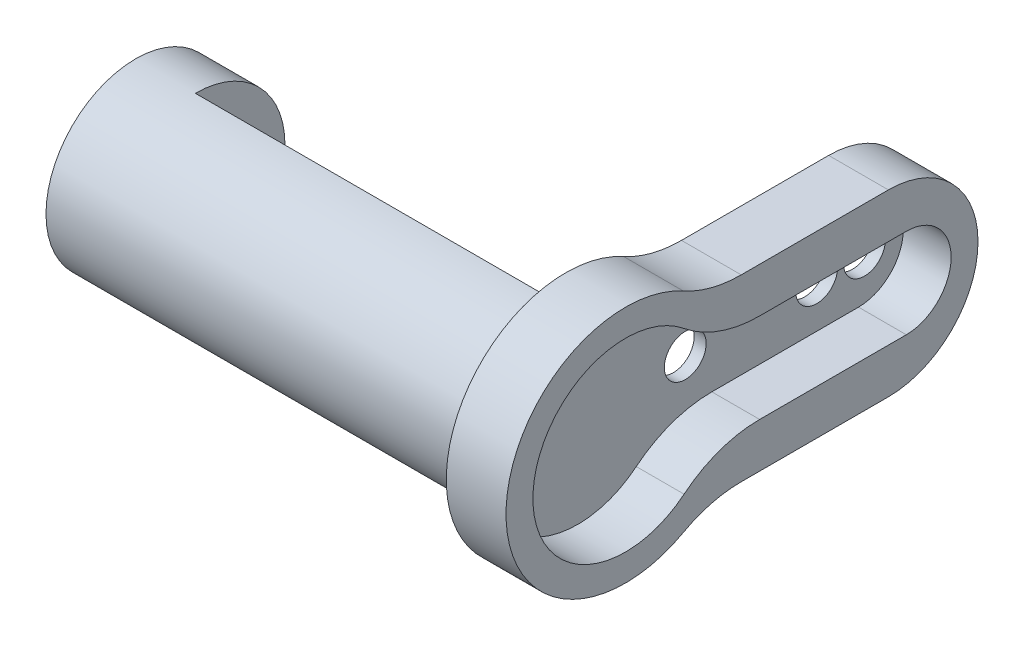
ISO-10303-21;
HEADER;
FILE_DESCRIPTION(('STEP AP214'),'2;1');
FILE_NAME('part.step','',(''),(''),'','','');
FILE_SCHEMA(('AUTOMOTIVE_DESIGN { 1 0 10303 214 1 1 1 1 }'));
ENDSEC;
DATA;
#1=APPLICATION_CONTEXT('core data for automotive mechanical design processes');
#2=APPLICATION_PROTOCOL_DEFINITION('international standard','automotive_design',2000,#1);
#3=PRODUCT_CONTEXT('',#1,'mechanical');
#4=PRODUCT('Part','Part','',(#3));
#5=PRODUCT_RELATED_PRODUCT_CATEGORY('part','',(#4));
#6=PRODUCT_DEFINITION_FORMATION('','',#4);
#7=PRODUCT_DEFINITION_CONTEXT('part definition',#1,'design');
#8=PRODUCT_DEFINITION('design','',#6,#7);
#9=PRODUCT_DEFINITION_SHAPE('','',#8);
#10=(LENGTH_UNIT() NAMED_UNIT(*) SI_UNIT(.MILLI.,.METRE.));
#11=(NAMED_UNIT(*) PLANE_ANGLE_UNIT() SI_UNIT($,.RADIAN.));
#12=(NAMED_UNIT(*) SI_UNIT($,.STERADIAN.) SOLID_ANGLE_UNIT());
#13=UNCERTAINTY_MEASURE_WITH_UNIT(LENGTH_MEASURE(1.E-05),#10,'distance_accuracy_value','');
#14=(GEOMETRIC_REPRESENTATION_CONTEXT(3) GLOBAL_UNCERTAINTY_ASSIGNED_CONTEXT((#13)) GLOBAL_UNIT_ASSIGNED_CONTEXT((#10,
#11,#12)) REPRESENTATION_CONTEXT('',''));
#15=CARTESIAN_POINT('',(0.,0.,0.));
#16=DIRECTION('',(0.,0.,1.));
#17=DIRECTION('',(1.,0.,0.));
#18=AXIS2_PLACEMENT_3D('',#15,#16,#17);
#19=CARTESIAN_POINT('',(18.,0.,0.));
#20=DIRECTION('',(-1.,0.,0.));
#21=DIRECTION('',(0.,0.,1.));
#22=AXIS2_PLACEMENT_3D('',#19,#20,#21);
#23=CYLINDRICAL_SURFACE('',#22,7.5);
#24=CARTESIAN_POINT('',(13.,0.,0.));
#25=DIRECTION('',(1.,0.,0.));
#26=DIRECTION('',(0.,0.,-1.));
#27=AXIS2_PLACEMENT_3D('',#24,#25,#26);
#28=CIRCLE('',#27,7.5);
#29=CARTESIAN_POINT('',(13.,7.5,0.));
#30=VERTEX_POINT('',#29);
#31=CARTESIAN_POINT('',(13.,-7.5,0.));
#32=VERTEX_POINT('',#31);
#33=EDGE_CURVE('E247',#30,#32,#28,.T.);
#34=ORIENTED_EDGE('',*,*,#33,.F.);
#35=DIRECTION('',(-1.,0.,0.));
#36=VECTOR('',#35,1.);
#37=CARTESIAN_POINT('',(29.7705098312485,7.5,0.));
#38=LINE('',#37,#36);
#39=CARTESIAN_POINT('',(-18.,7.5,0.));
#40=VERTEX_POINT('',#39);
#41=EDGE_CURVE('E152',#30,#40,#38,.T.);
#42=ORIENTED_EDGE('',*,*,#41,.T.);
#43=CARTESIAN_POINT('',(-18.,0.,0.));
#44=DIRECTION('',(-1.,0.,0.));
#45=DIRECTION('',(0.,0.,1.));
#46=AXIS2_PLACEMENT_3D('',#43,#44,#45);
#47=CIRCLE('',#46,7.5);
#48=CARTESIAN_POINT('',(-18.,-7.5,0.));
#49=VERTEX_POINT('',#48);
#50=EDGE_CURVE('E139',#40,#49,#47,.T.);
#51=ORIENTED_EDGE('',*,*,#50,.T.);
#52=DIRECTION('',(-1.,0.,0.));
#53=VECTOR('',#52,1.);
#54=CARTESIAN_POINT('',(29.7705098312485,-7.5,0.));
#55=LINE('',#54,#53);
#56=EDGE_CURVE('E150',#32,#49,#55,.T.);
#57=ORIENTED_EDGE('',*,*,#56,.F.);
#58=EDGE_LOOP('',(#34,#42,#51,#57));
#59=FACE_BOUND('',#58,.T.);
#60=CARTESIAN_POINT('',(-23.,0.,0.));
#61=DIRECTION('',(-1.,0.,0.));
#62=DIRECTION('',(0.,0.,1.));
#63=AXIS2_PLACEMENT_3D('',#60,#61,#62);
#64=CIRCLE('',#63,7.5);
#65=CARTESIAN_POINT('',(-23.,0.,7.5));
#66=VERTEX_POINT('',#65);
#67=EDGE_CURVE('E144',#66,#66,#64,.T.);
#68=ORIENTED_EDGE('',*,*,#67,.F.);
#69=EDGE_LOOP('',(#68));
#70=FACE_BOUND('',#69,.T.);
#71=ADVANCED_FACE('F37',(#59,#70),#23,.T.);
#72=CARTESIAN_POINT('',(18.,0.,0.));
#73=DIRECTION('',(1.,0.,0.));
#74=DIRECTION('',(0.,0.,-1.));
#75=AXIS2_PLACEMENT_3D('',#72,#73,#74);
#76=PLANE('',#75);
#77=CARTESIAN_POINT('',(18.,-13.75,-11.2249721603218));
#78=DIRECTION('',(-1.,0.,0.));
#79=DIRECTION('',(0.,0.,-1.));
#80=AXIS2_PLACEMENT_3D('',#77,#78,#79);
#81=CIRCLE('',#80,10.);
#82=CARTESIAN_POINT('',(18.,-6.00352112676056,-4.90104418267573));
#83=VERTEX_POINT('',#82);
#84=CARTESIAN_POINT('',(18.,-3.75,-11.2249721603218));
#85=VERTEX_POINT('',#84);
#86=EDGE_CURVE('E52',#83,#85,#81,.T.);
#87=ORIENTED_EDGE('',*,*,#86,.F.);
#88=CARTESIAN_POINT('',(18.,0.,0.));
#89=DIRECTION('',(1.,0.,0.));
#90=DIRECTION('',(0.,0.,-1.));
#91=AXIS2_PLACEMENT_3D('',#88,#89,#90);
#92=CIRCLE('',#91,7.75);
#93=CARTESIAN_POINT('',(18.,6.00352112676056,-4.90104418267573));
#94=VERTEX_POINT('',#93);
#95=EDGE_CURVE('E182',#94,#83,#92,.T.);
#96=ORIENTED_EDGE('',*,*,#95,.F.);
#97=CARTESIAN_POINT('',(18.,13.75,-11.2249721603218));
#98=DIRECTION('',(-1.,0.,0.));
#99=DIRECTION('',(0.,0.,1.));
#100=AXIS2_PLACEMENT_3D('',#97,#98,#99);
#101=CIRCLE('',#100,10.);
#102=CARTESIAN_POINT('',(18.,3.75,-11.2249721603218));
#103=VERTEX_POINT('',#102);
#104=EDGE_CURVE('E208',#103,#94,#101,.T.);
#105=ORIENTED_EDGE('',*,*,#104,.F.);
#106=DIRECTION('',(0.,0.,1.));
#107=VECTOR('',#106,1.);
#108=CARTESIAN_POINT('',(18.,3.75,-23.5));
#109=LINE('',#108,#107);
#110=CARTESIAN_POINT('',(18.,3.75,-23.5));
#111=VERTEX_POINT('',#110);
#112=EDGE_CURVE('E205',#111,#103,#109,.T.);
#113=ORIENTED_EDGE('',*,*,#112,.F.);
#114=CARTESIAN_POINT('',(18.,0.,-23.5));
#115=DIRECTION('',(1.,0.,0.));
#116=DIRECTION('',(0.,0.,-1.));
#117=AXIS2_PLACEMENT_3D('',#114,#115,#116);
#118=CIRCLE('',#117,3.75);
#119=CARTESIAN_POINT('',(18.,-3.75,-23.5));
#120=VERTEX_POINT('',#119);
#121=EDGE_CURVE('E202',#120,#111,#118,.T.);
#122=ORIENTED_EDGE('',*,*,#121,.F.);
#123=DIRECTION('',(0.,0.,-1.));
#124=VECTOR('',#123,1.);
#125=CARTESIAN_POINT('',(18.,-3.75,-23.5));
#126=LINE('',#125,#124);
#127=EDGE_CURVE('E199',#85,#120,#126,.T.);
#128=ORIENTED_EDGE('',*,*,#127,.F.);
#129=EDGE_LOOP('',(#87,#96,#105,#113,#122,#128));
#130=FACE_BOUND('',#129,.T.);
#131=DIRECTION('',(0.,0.,1.));
#132=VECTOR('',#131,1.);
#133=CARTESIAN_POINT('',(18.,7.5,0.));
#134=LINE('',#133,#132);
#135=CARTESIAN_POINT('',(18.,7.5,-22.));
#136=VERTEX_POINT('',#135);
#137=CARTESIAN_POINT('',(18.,7.5,-9.68245836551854));
#138=VERTEX_POINT('',#137);
#139=EDGE_CURVE('E233',#136,#138,#134,.T.);
#140=ORIENTED_EDGE('',*,*,#139,.T.);
#141=CARTESIAN_POINT('',(18.,17.5,-9.68245836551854));
#142=DIRECTION('',(1.,0.,0.));
#143=DIRECTION('',(0.,0.,-1.));
#144=AXIS2_PLACEMENT_3D('',#141,#142,#143);
#145=CIRCLE('',#144,10.);
#146=CARTESIAN_POINT('',(18.,8.75,-4.84122918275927));
#147=VERTEX_POINT('',#146);
#148=EDGE_CURVE('E11',#138,#147,#145,.F.);
#149=ORIENTED_EDGE('',*,*,#148,.T.);
#150=CARTESIAN_POINT('',(18.,0.,0.));
#151=DIRECTION('',(1.,0.,0.));
#152=DIRECTION('',(0.,0.,-1.));
#153=AXIS2_PLACEMENT_3D('',#150,#151,#152);
#154=CIRCLE('',#153,10.);
#155=CARTESIAN_POINT('',(18.,-8.75,-4.84122918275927));
#156=VERTEX_POINT('',#155);
#157=EDGE_CURVE('E215',#147,#156,#154,.T.);
#158=ORIENTED_EDGE('',*,*,#157,.T.);
#159=CARTESIAN_POINT('',(18.,-17.5,-9.68245836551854));
#160=DIRECTION('',(1.,0.,0.));
#161=DIRECTION('',(0.,0.,-1.));
#162=AXIS2_PLACEMENT_3D('',#159,#160,#161);
#163=CIRCLE('',#162,10.);
#164=CARTESIAN_POINT('',(18.,-7.5,-9.68245836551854));
#165=VERTEX_POINT('',#164);
#166=EDGE_CURVE('E261',#156,#165,#163,.F.);
#167=ORIENTED_EDGE('',*,*,#166,.T.);
#168=DIRECTION('',(0.,0.,-1.));
#169=VECTOR('',#168,1.);
#170=CARTESIAN_POINT('',(18.,-7.5,0.));
#171=LINE('',#170,#169);
#172=CARTESIAN_POINT('',(18.,-7.5,-22.));
#173=VERTEX_POINT('',#172);
#174=EDGE_CURVE('E229',#165,#173,#171,.T.);
#175=ORIENTED_EDGE('',*,*,#174,.T.);
#176=CARTESIAN_POINT('',(18.,0.,-22.));
#177=DIRECTION('',(1.,0.,0.));
#178=DIRECTION('',(0.,0.,-1.));
#179=AXIS2_PLACEMENT_3D('',#176,#177,#178);
#180=CIRCLE('',#179,7.5);
#181=EDGE_CURVE('E240',#173,#136,#180,.T.);
#182=ORIENTED_EDGE('',*,*,#181,.T.);
#183=EDGE_LOOP('',(#140,#149,#158,#167,#175,#182));
#184=FACE_BOUND('',#183,.T.);
#185=ADVANCED_FACE('F279',(#130,#184),#76,.T.);
#186=CARTESIAN_POINT('',(13.,7.5,0.));
#187=DIRECTION('',(0.,1.,0.));
#188=DIRECTION('',(0.,0.,1.));
#189=AXIS2_PLACEMENT_3D('',#186,#187,#188);
#190=PLANE('',#189);
#191=DIRECTION('',(0.,0.,1.));
#192=VECTOR('',#191,1.);
#193=CARTESIAN_POINT('',(13.,7.5,0.));
#194=LINE('',#193,#192);
#195=CARTESIAN_POINT('',(13.,7.5,-22.));
#196=VERTEX_POINT('',#195);
#197=CARTESIAN_POINT('',(13.,7.5,-9.68245836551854));
#198=VERTEX_POINT('',#197);
#199=EDGE_CURVE('E236',#196,#198,#194,.T.);
#200=ORIENTED_EDGE('',*,*,#199,.T.);
#201=DIRECTION('',(-1.,0.,0.));
#202=VECTOR('',#201,1.);
#203=CARTESIAN_POINT('',(18.,7.5,-9.68245836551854));
#204=LINE('',#203,#202);
#205=EDGE_CURVE('E259',#198,#138,#204,.F.);
#206=ORIENTED_EDGE('',*,*,#205,.T.);
#207=ORIENTED_EDGE('',*,*,#139,.F.);
#208=DIRECTION('',(1.,0.,0.));
#209=VECTOR('',#208,1.);
#210=CARTESIAN_POINT('',(13.,7.5,-22.));
#211=LINE('',#210,#209);
#212=EDGE_CURVE('E245',#196,#136,#211,.T.);
#213=ORIENTED_EDGE('',*,*,#212,.F.);
#214=EDGE_LOOP('',(#200,#206,#207,#213));
#215=FACE_BOUND('',#214,.T.);
#216=ADVANCED_FACE('F289',(#215),#190,.T.);
#217=CARTESIAN_POINT('',(13.,0.,-22.));
#218=DIRECTION('',(1.,0.,0.));
#219=DIRECTION('',(0.,0.,-1.));
#220=AXIS2_PLACEMENT_3D('',#217,#218,#219);
#221=CYLINDRICAL_SURFACE('',#220,7.5);
#222=ORIENTED_EDGE('',*,*,#181,.F.);
#223=DIRECTION('',(1.,0.,0.));
#224=VECTOR('',#223,1.);
#225=CARTESIAN_POINT('',(13.,-7.5,-22.));
#226=LINE('',#225,#224);
#227=CARTESIAN_POINT('',(13.,-7.5,-22.));
#228=VERTEX_POINT('',#227);
#229=EDGE_CURVE('E238',#228,#173,#226,.T.);
#230=ORIENTED_EDGE('',*,*,#229,.F.);
#231=CARTESIAN_POINT('',(13.,0.,-22.));
#232=DIRECTION('',(1.,0.,0.));
#233=DIRECTION('',(0.,0.,-1.));
#234=AXIS2_PLACEMENT_3D('',#231,#232,#233);
#235=CIRCLE('',#234,7.5);
#236=EDGE_CURVE('E232',#228,#196,#235,.T.);
#237=ORIENTED_EDGE('',*,*,#236,.T.);
#238=ORIENTED_EDGE('',*,*,#212,.T.);
#239=EDGE_LOOP('',(#222,#230,#237,#238));
#240=FACE_BOUND('',#239,.T.);
#241=ADVANCED_FACE('F285',(#240),#221,.T.);
#242=CARTESIAN_POINT('',(13.,-7.5,0.));
#243=DIRECTION('',(0.,-1.,0.));
#244=DIRECTION('',(0.,0.,-1.));
#245=AXIS2_PLACEMENT_3D('',#242,#243,#244);
#246=PLANE('',#245);
#247=ORIENTED_EDGE('',*,*,#174,.F.);
#248=DIRECTION('',(-1.,0.,0.));
#249=VECTOR('',#248,1.);
#250=CARTESIAN_POINT('',(13.,-7.5,-9.68245836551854));
#251=LINE('',#250,#249);
#252=CARTESIAN_POINT('',(13.,-7.5,-9.68245836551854));
#253=VERTEX_POINT('',#252);
#254=EDGE_CURVE('E257',#165,#253,#251,.T.);
#255=ORIENTED_EDGE('',*,*,#254,.T.);
#256=DIRECTION('',(0.,0.,-1.));
#257=VECTOR('',#256,1.);
#258=CARTESIAN_POINT('',(13.,-7.5,0.));
#259=LINE('',#258,#257);
#260=EDGE_CURVE('E230',#253,#228,#259,.T.);
#261=ORIENTED_EDGE('',*,*,#260,.T.);
#262=ORIENTED_EDGE('',*,*,#229,.T.);
#263=EDGE_LOOP('',(#247,#255,#261,#262));
#264=FACE_BOUND('',#263,.T.);
#265=ADVANCED_FACE('F281',(#264),#246,.T.);
#266=CARTESIAN_POINT('',(13.,0.,0.));
#267=DIRECTION('',(1.,0.,0.));
#268=DIRECTION('',(0.,0.,-1.));
#269=AXIS2_PLACEMENT_3D('',#266,#267,#268);
#270=PLANE('',#269);
#271=ORIENTED_EDGE('',*,*,#33,.T.);
#272=DIRECTION('',(0.,1.,0.));
#273=VECTOR('',#272,1.);
#274=CARTESIAN_POINT('',(13.,7.5,0.));
#275=LINE('',#274,#273);
#276=EDGE_CURVE('E143',#32,#30,#275,.T.);
#277=ORIENTED_EDGE('',*,*,#276,.T.);
#278=EDGE_LOOP('',(#271,#277));
#279=FACE_BOUND('',#278,.T.);
#280=CARTESIAN_POINT('',(13.,0.,-24.));
#281=DIRECTION('',(1.,0.,0.));
#282=DIRECTION('',(0.,0.,-1.));
#283=AXIS2_PLACEMENT_3D('',#280,#281,#282);
#284=CIRCLE('',#283,1.75);
#285=CARTESIAN_POINT('',(13.,0.,-25.75));
#286=VERTEX_POINT('',#285);
#287=EDGE_CURVE('E175',#286,#286,#284,.T.);
#288=ORIENTED_EDGE('',*,*,#287,.T.);
#289=EDGE_LOOP('',(#288));
#290=FACE_BOUND('',#289,.T.);
#291=CARTESIAN_POINT('',(13.,0.,-20.));
#292=DIRECTION('',(1.,0.,0.));
#293=DIRECTION('',(0.,0.,-1.));
#294=AXIS2_PLACEMENT_3D('',#291,#292,#293);
#295=CIRCLE('',#294,1.75);
#296=CARTESIAN_POINT('',(13.,0.,-21.75));
#297=VERTEX_POINT('',#296);
#298=EDGE_CURVE('E172',#297,#297,#295,.T.);
#299=ORIENTED_EDGE('',*,*,#298,.T.);
#300=EDGE_LOOP('',(#299));
#301=FACE_BOUND('',#300,.T.);
#302=CARTESIAN_POINT('',(13.,0.,-9.00000000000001));
#303=DIRECTION('',(1.,0.,0.));
#304=DIRECTION('',(0.,0.,-1.));
#305=AXIS2_PLACEMENT_3D('',#302,#303,#304);
#306=CIRCLE('',#305,1.75);
#307=CARTESIAN_POINT('',(13.,0.,-10.75));
#308=VERTEX_POINT('',#307);
#309=EDGE_CURVE('E167',#308,#308,#306,.T.);
#310=ORIENTED_EDGE('',*,*,#309,.T.);
#311=EDGE_LOOP('',(#310));
#312=FACE_BOUND('',#311,.T.);
#313=ORIENTED_EDGE('',*,*,#260,.F.);
#314=CARTESIAN_POINT('',(13.,-17.5,-9.68245836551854));
#315=DIRECTION('',(1.,0.,0.));
#316=DIRECTION('',(0.,0.,-1.));
#317=AXIS2_PLACEMENT_3D('',#314,#315,#316);
#318=CIRCLE('',#317,10.);
#319=CARTESIAN_POINT('',(13.,-8.75,-4.84122918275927));
#320=VERTEX_POINT('',#319);
#321=EDGE_CURVE('E263',#253,#320,#318,.T.);
#322=ORIENTED_EDGE('',*,*,#321,.T.);
#323=CARTESIAN_POINT('',(13.,0.,0.));
#324=DIRECTION('',(1.,0.,0.));
#325=DIRECTION('',(0.,0.,-1.));
#326=AXIS2_PLACEMENT_3D('',#323,#324,#325);
#327=CIRCLE('',#326,10.);
#328=CARTESIAN_POINT('',(13.,8.75,-4.84122918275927));
#329=VERTEX_POINT('',#328);
#330=EDGE_CURVE('E227',#320,#329,#327,.F.);
#331=ORIENTED_EDGE('',*,*,#330,.T.);
#332=CARTESIAN_POINT('',(13.,17.5,-9.68245836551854));
#333=DIRECTION('',(1.,0.,0.));
#334=DIRECTION('',(0.,0.,-1.));
#335=AXIS2_PLACEMENT_3D('',#332,#333,#334);
#336=CIRCLE('',#335,10.);
#337=EDGE_CURVE('E45',#329,#198,#336,.T.);
#338=ORIENTED_EDGE('',*,*,#337,.T.);
#339=ORIENTED_EDGE('',*,*,#199,.F.);
#340=ORIENTED_EDGE('',*,*,#236,.F.);
#341=EDGE_LOOP('',(#313,#322,#331,#338,#339,#340));
#342=FACE_BOUND('',#341,.T.);
#343=ADVANCED_FACE('F267',(#279,#290,#301,#312,#342),#270,.F.);
#344=CARTESIAN_POINT('',(-15.2842712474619,0.,0.));
#345=DIRECTION('',(1.,0.,0.));
#346=DIRECTION('',(0.,0.,-1.));
#347=AXIS2_PLACEMENT_3D('',#344,#345,#346);
#348=CYLINDRICAL_SURFACE('',#347,10.);
#349=ORIENTED_EDGE('',*,*,#330,.F.);
#350=DIRECTION('',(1.,0.,0.));
#351=VECTOR('',#350,1.);
#352=CARTESIAN_POINT('',(-15.2842712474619,-8.75,-4.84122918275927));
#353=LINE('',#352,#351);
#354=EDGE_CURVE('E254',#320,#156,#353,.T.);
#355=ORIENTED_EDGE('',*,*,#354,.T.);
#356=ORIENTED_EDGE('',*,*,#157,.F.);
#357=DIRECTION('',(1.,0.,0.));
#358=VECTOR('',#357,1.);
#359=CARTESIAN_POINT('',(-15.2842712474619,8.75,-4.84122918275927));
#360=LINE('',#359,#358);
#361=EDGE_CURVE('E251',#147,#329,#360,.F.);
#362=ORIENTED_EDGE('',*,*,#361,.T.);
#363=EDGE_LOOP('',(#349,#355,#356,#362));
#364=FACE_BOUND('',#363,.T.);
#365=ADVANCED_FACE('F273',(#364),#348,.T.);
#366=CARTESIAN_POINT('',(-15.2842712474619,-17.5,-9.68245836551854));
#367=DIRECTION('',(1.,0.,0.));
#368=DIRECTION('',(0.,0.,-1.));
#369=AXIS2_PLACEMENT_3D('',#366,#367,#368);
#370=CYLINDRICAL_SURFACE('',#369,10.);
#371=ORIENTED_EDGE('',*,*,#321,.F.);
#372=ORIENTED_EDGE('',*,*,#254,.F.);
#373=ORIENTED_EDGE('',*,*,#166,.F.);
#374=ORIENTED_EDGE('',*,*,#354,.F.);
#375=EDGE_LOOP('',(#371,#372,#373,#374));
#376=FACE_BOUND('',#375,.T.);
#377=ADVANCED_FACE('F276',(#376),#370,.F.);
#378=CARTESIAN_POINT('',(-15.2842712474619,17.5,-9.68245836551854));
#379=DIRECTION('',(1.,0.,0.));
#380=DIRECTION('',(0.,0.,-1.));
#381=AXIS2_PLACEMENT_3D('',#378,#379,#380);
#382=CYLINDRICAL_SURFACE('',#381,10.);
#383=ORIENTED_EDGE('',*,*,#148,.F.);
#384=ORIENTED_EDGE('',*,*,#205,.F.);
#385=ORIENTED_EDGE('',*,*,#337,.F.);
#386=ORIENTED_EDGE('',*,*,#361,.F.);
#387=EDGE_LOOP('',(#383,#384,#385,#386));
#388=FACE_BOUND('',#387,.T.);
#389=ADVANCED_FACE('F39',(#388),#382,.F.);
#390=CARTESIAN_POINT('',(14.,-13.75,-11.2249721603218));
#391=DIRECTION('',(1.,0.,0.));
#392=DIRECTION('',(0.,0.,-1.));
#393=AXIS2_PLACEMENT_3D('',#390,#391,#392);
#394=CYLINDRICAL_SURFACE('',#393,10.);
#395=ORIENTED_EDGE('',*,*,#86,.T.);
#396=DIRECTION('',(1.,0.,0.));
#397=VECTOR('',#396,1.);
#398=CARTESIAN_POINT('',(14.,-3.75,-11.2249721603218));
#399=LINE('',#398,#397);
#400=CARTESIAN_POINT('',(14.,-3.75,-11.2249721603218));
#401=VERTEX_POINT('',#400);
#402=EDGE_CURVE('E197',#401,#85,#399,.T.);
#403=ORIENTED_EDGE('',*,*,#402,.F.);
#404=CARTESIAN_POINT('',(14.,-13.75,-11.2249721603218));
#405=DIRECTION('',(-1.,0.,0.));
#406=DIRECTION('',(0.,0.,-1.));
#407=AXIS2_PLACEMENT_3D('',#404,#405,#406);
#408=CIRCLE('',#407,10.);
#409=CARTESIAN_POINT('',(14.,-6.00352112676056,-4.90104418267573));
#410=VERTEX_POINT('',#409);
#411=EDGE_CURVE('E178',#410,#401,#408,.T.);
#412=ORIENTED_EDGE('',*,*,#411,.F.);
#413=DIRECTION('',(1.,0.,0.));
#414=VECTOR('',#413,1.);
#415=CARTESIAN_POINT('',(14.,-6.00352112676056,-4.90104418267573));
#416=LINE('',#415,#414);
#417=EDGE_CURVE('E213',#410,#83,#416,.T.);
#418=ORIENTED_EDGE('',*,*,#417,.T.);
#419=EDGE_LOOP('',(#395,#403,#412,#418));
#420=FACE_BOUND('',#419,.T.);
#421=ADVANCED_FACE('F293',(#420),#394,.T.);
#422=CARTESIAN_POINT('',(14.,0.,0.));
#423=DIRECTION('',(1.,0.,0.));
#424=DIRECTION('',(0.,0.,-1.));
#425=AXIS2_PLACEMENT_3D('',#422,#423,#424);
#426=CYLINDRICAL_SURFACE('',#425,7.75);
#427=ORIENTED_EDGE('',*,*,#95,.T.);
#428=ORIENTED_EDGE('',*,*,#417,.F.);
#429=CARTESIAN_POINT('',(14.,0.,0.));
#430=DIRECTION('',(1.,0.,0.));
#431=DIRECTION('',(0.,0.,-1.));
#432=AXIS2_PLACEMENT_3D('',#429,#430,#431);
#433=CIRCLE('',#432,7.75);
#434=CARTESIAN_POINT('',(14.,6.00352112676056,-4.90104418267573));
#435=VERTEX_POINT('',#434);
#436=EDGE_CURVE('E194',#435,#410,#433,.T.);
#437=ORIENTED_EDGE('',*,*,#436,.F.);
#438=DIRECTION('',(1.,0.,0.));
#439=VECTOR('',#438,1.);
#440=CARTESIAN_POINT('',(14.,6.00352112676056,-4.90104418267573));
#441=LINE('',#440,#439);
#442=EDGE_CURVE('E216',#435,#94,#441,.T.);
#443=ORIENTED_EDGE('',*,*,#442,.T.);
#444=EDGE_LOOP('',(#427,#428,#437,#443));
#445=FACE_BOUND('',#444,.T.);
#446=ADVANCED_FACE('F298',(#445),#426,.F.);
#447=CARTESIAN_POINT('',(14.,13.75,-11.2249721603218));
#448=DIRECTION('',(1.,0.,0.));
#449=DIRECTION('',(0.,0.,-1.));
#450=AXIS2_PLACEMENT_3D('',#447,#448,#449);
#451=CYLINDRICAL_SURFACE('',#450,10.);
#452=ORIENTED_EDGE('',*,*,#104,.T.);
#453=ORIENTED_EDGE('',*,*,#442,.F.);
#454=CARTESIAN_POINT('',(14.,13.75,-11.2249721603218));
#455=DIRECTION('',(-1.,0.,0.));
#456=DIRECTION('',(0.,0.,1.));
#457=AXIS2_PLACEMENT_3D('',#454,#455,#456);
#458=CIRCLE('',#457,10.);
#459=CARTESIAN_POINT('',(14.,3.75,-11.2249721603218));
#460=VERTEX_POINT('',#459);
#461=EDGE_CURVE('E191',#460,#435,#458,.T.);
#462=ORIENTED_EDGE('',*,*,#461,.F.);
#463=DIRECTION('',(1.,0.,0.));
#464=VECTOR('',#463,1.);
#465=CARTESIAN_POINT('',(14.,3.75,-11.2249721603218));
#466=LINE('',#465,#464);
#467=EDGE_CURVE('E218',#460,#103,#466,.T.);
#468=ORIENTED_EDGE('',*,*,#467,.T.);
#469=EDGE_LOOP('',(#452,#453,#462,#468));
#470=FACE_BOUND('',#469,.T.);
#471=ADVANCED_FACE('F331',(#470),#451,.T.);
#472=CARTESIAN_POINT('',(14.,3.75,-23.5));
#473=DIRECTION('',(0.,1.,0.));
#474=DIRECTION('',(0.,0.,1.));
#475=AXIS2_PLACEMENT_3D('',#472,#473,#474);
#476=PLANE('',#475);
#477=ORIENTED_EDGE('',*,*,#112,.T.);
#478=ORIENTED_EDGE('',*,*,#467,.F.);
#479=DIRECTION('',(0.,0.,1.));
#480=VECTOR('',#479,1.);
#481=CARTESIAN_POINT('',(14.,3.75,-23.5));
#482=LINE('',#481,#480);
#483=CARTESIAN_POINT('',(14.,3.75,-23.5));
#484=VERTEX_POINT('',#483);
#485=EDGE_CURVE('E188',#484,#460,#482,.T.);
#486=ORIENTED_EDGE('',*,*,#485,.F.);
#487=DIRECTION('',(1.,0.,0.));
#488=VECTOR('',#487,1.);
#489=CARTESIAN_POINT('',(14.,3.75,-23.5));
#490=LINE('',#489,#488);
#491=EDGE_CURVE('E220',#484,#111,#490,.T.);
#492=ORIENTED_EDGE('',*,*,#491,.T.);
#493=EDGE_LOOP('',(#477,#478,#486,#492));
#494=FACE_BOUND('',#493,.T.);
#495=ADVANCED_FACE('F327',(#494),#476,.F.);
#496=CARTESIAN_POINT('',(14.,0.,-23.5));
#497=DIRECTION('',(1.,0.,0.));
#498=DIRECTION('',(0.,0.,-1.));
#499=AXIS2_PLACEMENT_3D('',#496,#497,#498);
#500=CYLINDRICAL_SURFACE('',#499,3.75);
#501=ORIENTED_EDGE('',*,*,#121,.T.);
#502=ORIENTED_EDGE('',*,*,#491,.F.);
#503=CARTESIAN_POINT('',(14.,0.,-23.5));
#504=DIRECTION('',(1.,0.,0.));
#505=DIRECTION('',(0.,0.,-1.));
#506=AXIS2_PLACEMENT_3D('',#503,#504,#505);
#507=CIRCLE('',#506,3.75);
#508=CARTESIAN_POINT('',(14.,-3.75,-23.5));
#509=VERTEX_POINT('',#508);
#510=EDGE_CURVE('E185',#509,#484,#507,.T.);
#511=ORIENTED_EDGE('',*,*,#510,.F.);
#512=DIRECTION('',(1.,0.,0.));
#513=VECTOR('',#512,1.);
#514=CARTESIAN_POINT('',(14.,-3.75,-23.5));
#515=LINE('',#514,#513);
#516=EDGE_CURVE('E222',#509,#120,#515,.T.);
#517=ORIENTED_EDGE('',*,*,#516,.T.);
#518=EDGE_LOOP('',(#501,#502,#511,#517));
#519=FACE_BOUND('',#518,.T.);
#520=ADVANCED_FACE('F323',(#519),#500,.F.);
#521=CARTESIAN_POINT('',(14.,-3.75,-23.5));
#522=DIRECTION('',(0.,-1.,0.));
#523=DIRECTION('',(0.,0.,-1.));
#524=AXIS2_PLACEMENT_3D('',#521,#522,#523);
#525=PLANE('',#524);
#526=ORIENTED_EDGE('',*,*,#127,.T.);
#527=ORIENTED_EDGE('',*,*,#516,.F.);
#528=DIRECTION('',(0.,0.,-1.));
#529=VECTOR('',#528,1.);
#530=CARTESIAN_POINT('',(14.,-3.75,-23.5));
#531=LINE('',#530,#529);
#532=EDGE_CURVE('E181',#401,#509,#531,.T.);
#533=ORIENTED_EDGE('',*,*,#532,.F.);
#534=ORIENTED_EDGE('',*,*,#402,.T.);
#535=EDGE_LOOP('',(#526,#527,#533,#534));
#536=FACE_BOUND('',#535,.T.);
#537=ADVANCED_FACE('F319',(#536),#525,.F.);
#538=CARTESIAN_POINT('',(14.,-13.75,-11.2249721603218));
#539=DIRECTION('',(1.,0.,0.));
#540=DIRECTION('',(0.,0.,-1.));
#541=AXIS2_PLACEMENT_3D('',#538,#539,#540);
#542=PLANE('',#541);
#543=CARTESIAN_POINT('',(14.,0.,-24.));
#544=DIRECTION('',(1.,0.,0.));
#545=DIRECTION('',(0.,0.,-1.));
#546=AXIS2_PLACEMENT_3D('',#543,#544,#545);
#547=CIRCLE('',#546,1.75);
#548=CARTESIAN_POINT('',(14.,0.,-25.75));
#549=VERTEX_POINT('',#548);
#550=EDGE_CURVE('E164',#549,#549,#547,.T.);
#551=ORIENTED_EDGE('',*,*,#550,.F.);
#552=EDGE_LOOP('',(#551));
#553=FACE_BOUND('',#552,.T.);
#554=CARTESIAN_POINT('',(14.,0.,-20.));
#555=DIRECTION('',(1.,0.,0.));
#556=DIRECTION('',(0.,0.,-1.));
#557=AXIS2_PLACEMENT_3D('',#554,#555,#556);
#558=CIRCLE('',#557,1.75);
#559=CARTESIAN_POINT('',(14.,0.,-21.75));
#560=VERTEX_POINT('',#559);
#561=EDGE_CURVE('E159',#560,#560,#558,.T.);
#562=ORIENTED_EDGE('',*,*,#561,.F.);
#563=EDGE_LOOP('',(#562));
#564=FACE_BOUND('',#563,.T.);
#565=CARTESIAN_POINT('',(14.,0.,-9.00000000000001));
#566=DIRECTION('',(1.,0.,0.));
#567=DIRECTION('',(0.,0.,-1.));
#568=AXIS2_PLACEMENT_3D('',#565,#566,#567);
#569=CIRCLE('',#568,1.75);
#570=CARTESIAN_POINT('',(14.,0.,-10.75));
#571=VERTEX_POINT('',#570);
#572=EDGE_CURVE('E156',#571,#571,#569,.T.);
#573=ORIENTED_EDGE('',*,*,#572,.F.);
#574=EDGE_LOOP('',(#573));
#575=FACE_BOUND('',#574,.T.);
#576=ORIENTED_EDGE('',*,*,#411,.T.);
#577=ORIENTED_EDGE('',*,*,#532,.T.);
#578=ORIENTED_EDGE('',*,*,#510,.T.);
#579=ORIENTED_EDGE('',*,*,#485,.T.);
#580=ORIENTED_EDGE('',*,*,#461,.T.);
#581=ORIENTED_EDGE('',*,*,#436,.T.);
#582=EDGE_LOOP('',(#576,#577,#578,#579,#580,#581));
#583=FACE_BOUND('',#582,.T.);
#584=ADVANCED_FACE('F322',(#553,#564,#575,#583),#542,.T.);
#585=CARTESIAN_POINT('',(-10.,0.,-9.00000000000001));
#586=DIRECTION('',(1.,0.,0.));
#587=DIRECTION('',(0.,0.,-1.));
#588=AXIS2_PLACEMENT_3D('',#585,#586,#587);
#589=CYLINDRICAL_SURFACE('',#588,1.75);
#590=ORIENTED_EDGE('',*,*,#572,.T.);
#591=EDGE_LOOP('',(#590));
#592=FACE_BOUND('',#591,.T.);
#593=ORIENTED_EDGE('',*,*,#309,.F.);
#594=EDGE_LOOP('',(#593));
#595=FACE_BOUND('',#594,.T.);
#596=ADVANCED_FACE('F341',(#592,#595),#589,.F.);
#597=CARTESIAN_POINT('',(-10.,0.,-20.));
#598=DIRECTION('',(1.,0.,0.));
#599=DIRECTION('',(0.,0.,-1.));
#600=AXIS2_PLACEMENT_3D('',#597,#598,#599);
#601=CYLINDRICAL_SURFACE('',#600,1.75);
#602=ORIENTED_EDGE('',*,*,#561,.T.);
#603=EDGE_LOOP('',(#602));
#604=FACE_BOUND('',#603,.T.);
#605=ORIENTED_EDGE('',*,*,#298,.F.);
#606=EDGE_LOOP('',(#605));
#607=FACE_BOUND('',#606,.T.);
#608=ADVANCED_FACE('F345',(#604,#607),#601,.F.);
#609=CARTESIAN_POINT('',(-10.,0.,-24.));
#610=DIRECTION('',(1.,0.,0.));
#611=DIRECTION('',(0.,0.,-1.));
#612=AXIS2_PLACEMENT_3D('',#609,#610,#611);
#613=CYLINDRICAL_SURFACE('',#612,1.75);
#614=ORIENTED_EDGE('',*,*,#550,.T.);
#615=EDGE_LOOP('',(#614));
#616=FACE_BOUND('',#615,.T.);
#617=ORIENTED_EDGE('',*,*,#287,.F.);
#618=EDGE_LOOP('',(#617));
#619=FACE_BOUND('',#618,.T.);
#620=ADVANCED_FACE('F349',(#616,#619),#613,.F.);
#621=CARTESIAN_POINT('',(29.7705098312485,7.5,0.));
#622=DIRECTION('',(0.,0.,1.));
#623=DIRECTION('',(0.,-1.,0.));
#624=AXIS2_PLACEMENT_3D('',#621,#622,#623);
#625=PLANE('',#624);
#626=ORIENTED_EDGE('',*,*,#56,.T.);
#627=DIRECTION('',(0.,1.,0.));
#628=VECTOR('',#627,1.);
#629=CARTESIAN_POINT('',(-18.,7.5,0.));
#630=LINE('',#629,#628);
#631=EDGE_CURVE('E136',#49,#40,#630,.T.);
#632=ORIENTED_EDGE('',*,*,#631,.T.);
#633=ORIENTED_EDGE('',*,*,#41,.F.);
#634=ORIENTED_EDGE('',*,*,#276,.F.);
#635=EDGE_LOOP('',(#626,#632,#633,#634));
#636=FACE_BOUND('',#635,.T.);
#637=ADVANCED_FACE('F154',(#636),#625,.F.);
#638=CARTESIAN_POINT('',(-23.,0.,0.));
#639=DIRECTION('',(-1.,0.,0.));
#640=DIRECTION('',(0.,0.,1.));
#641=AXIS2_PLACEMENT_3D('',#638,#639,#640);
#642=PLANE('',#641);
#643=ORIENTED_EDGE('',*,*,#67,.T.);
#644=EDGE_LOOP('',(#643));
#645=FACE_BOUND('',#644,.T.);
#646=ADVANCED_FACE('F356',(#645),#642,.T.);
#647=CARTESIAN_POINT('',(-18.,0.,0.));
#648=DIRECTION('',(-1.,0.,0.));
#649=DIRECTION('',(0.,0.,1.));
#650=AXIS2_PLACEMENT_3D('',#647,#648,#649);
#651=PLANE('',#650);
#652=ORIENTED_EDGE('',*,*,#631,.F.);
#653=ORIENTED_EDGE('',*,*,#50,.F.);
#654=EDGE_LOOP('',(#652,#653));
#655=FACE_BOUND('',#654,.T.);
#656=ADVANCED_FACE('F138',(#655),#651,.F.);
#657=CLOSED_SHELL('',(#71,#185,#216,#241,#265,#343,#365,#377,#389,#421,#446,#471,#495,#520,#537,
#584,#596,#608,#620,#637,#646,#656));
#658=MANIFOLD_SOLID_BREP('B2',#657);
#659=ADVANCED_BREP_SHAPE_REPRESENTATION('',(#18,#658),#14);
#660=SHAPE_DEFINITION_REPRESENTATION(#9,#659);
ENDSEC;
END-ISO-10303-21;
